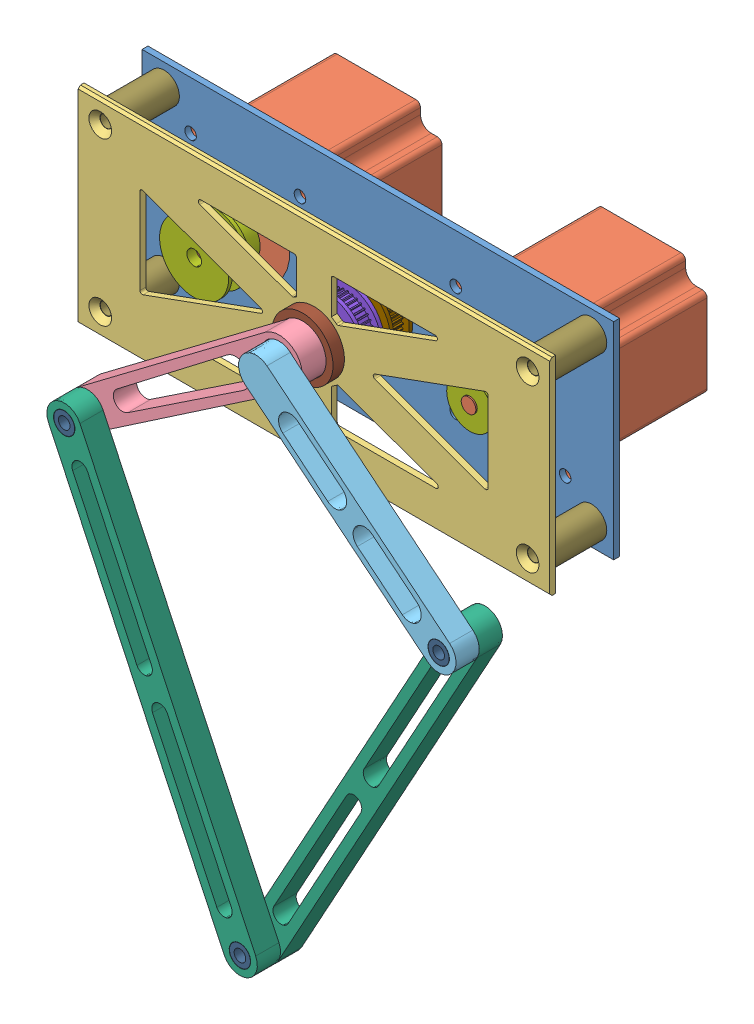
SolidWorks assembly Full Assem.SLDASM, configuration Default (file format 13000). Lengths in mm.
Overall size (203.2 274.68 109.08).
23 component instances, 12 part files, 50 mates.
Components (placement in the parent):
- Motor Plate-1: Motor Plate.SLDPRT [Default] at (75.9678 110.6506 152.779) size (203.2 88.9 2.54)
- NEMA23-1: NEMA23.SLDPRT [Varsayılan] at (18.8428 110.6506 151.509) x (0 1 0) z (0 0 1) size (56.4 56.4 74.6)
- NEMA23-2: NEMA23.SLDPRT [Varsayılan] at (133.0928 110.6506 151.509) size (56.4 56.4 74.6)
- Front Plate-1: Front Plate.SLDPRT [Default] at (75.9678 110.6506 180.319) size (203.2 88.9 2.54)
- Short Linkage Outer-1: Short Linkage Outer.SLDPRT [Default] at (75.9678 110.6506 196.589) x (-0.582335 0.812949 0) z (0 0 -1) size (20 119.1 32.94)
- Short Linkage Inner-1: Short Linkage Inner.SLDPRT [Default] at (115.3352 78.5437 206.589) x (-0.632024 -0.774949 0) z (0 0 -1) size (15 116.6 60.08)
- Long Linkage V1-1: Long Linkage V1.SLDPRT [Default] at (111.8924 -31.4765 186.589) x (0.876416 -0.481554 0) z (0 0 1) size (15 192.8 10)
- Long Linkage V1-2: Long Linkage V1.SLDPRT [Default] at (31.2272 -28.9523 196.589) x (0.90481 0.425816 0) z (0 0 1) size (15 192.8 10)
- motor pulleys-1: motor pulleys.SLDPRT [Default] at (123.9278 104.7502 157.939) x (0 0 1) z (0.541314 -0.84082 0) size (18.41 29.8 29.8)
- motor pulleys-2: motor pulleys.SLDPRT [Default] at (10.9792 118.1987 171.2421) x (0 0 -1) z (0.692492 0.721426 0) size (18.41 29.8 29.8)
- outer shaft pulley 20.25mm-1: outer shaft pulley 20.25mm.SLDPRT [Default] at (75.9678 110.6506 171.049) x (0.582335 -0.812949 0) z (0 0 1) size (30 30 9.6)
- inner shaft pulley v2-1: inner shaft pulley v2.SLDPRT [Default] at (75.9478 110.5272 158.849) x (0.774949 -0.632024 0) z (0 0 1) size (30 30 9.6)
- Brass Bushing-1: Brass Bushing.SLDPRT [Default] at (-6.6278 51.4853 201.589) x (0.4597 0.888074 0) z (-0.888074 0.4597 0) size (9 10 9)
- Brass Bushing-2: Brass Bushing.SLDPRT [Default] at (-6.6278 51.4853 191.589) x (0.864191 0.503164 0) z (-0.503164 0.864191 0) size (9 10 9)
- Brass Bushing-3: Brass Bushing.SLDPRT [Default] at (154.7026 46.4369 191.589) x (0.864191 0.503164 0) z (-0.503164 0.864191 0) size (9 10 9)
- Brass Bushing-4: Brass Bushing.SLDPRT [Default] at (154.7026 46.4369 201.589) x (0.938309 0.345799 0) z (-0.345799 0.938309 0) size (9 10 9)
- Brass Bushing-5: Brass Bushing.SLDPRT [Default] at (69.0822 -109.3899 191.589) x (0.864191 0.503164 0) z (-0.503164 0.864191 0) size (9 10 9)
- Brass Bushing-6: Brass Bushing.SLDPRT [Default] at (69.0822 -109.3899 201.589) x (-0.505691 0.862715 0) z (-0.862715 -0.505691 0) size (9 10 9)
- 5mm spacer-3: 5mm spacer.SLDPRT [Default] at (75.9678 110.6506 186.489) x (0.800581 -0.599225 0) z (0.599225 0.800581 0) size (26.26 4.9 26.26)
- Gear Box Spacer-5: Gear Box Spacer.SLDPRT [Default] at (168.0428 75.7256 166.549) x (0.994186 -0.107675 0) z (0 0 1) size (13.11 13.11 25)
- Gear Box Spacer-6: Gear Box Spacer.SLDPRT [Default] at (168.0428 145.5756 166.549) x (0.933353 -0.358959 0) z (0 0 1) size (13.11 13.11 25)
- Gear Box Spacer-7: Gear Box Spacer.SLDPRT [Default] at (-16.1072 75.7256 166.549) x (0.967065 -0.254529 0) z (0 0 1) size (13.11 13.11 25)
- Gear Box Spacer-8: Gear Box Spacer.SLDPRT [Default] at (-16.1072 145.5756 166.549) size (13.11 13.11 25)
Mates (geometry in assembly coordinates):
- Concentric3: concentric aligned: circle of Motor Plate-1; circle of NEMA23-1
- Coincident4: coincident anti-aligned: plane of Motor Plate-1 through (75.9678 110.6506 151.509) normal (0 0 -1); plane of NEMA23-1 through (-4.7272 134.2206 151.509) normal (0 0 1)
- Concentric4: concentric anti-aligned: cylinder of Motor Plate-1 through (-4.7272 134.2206 154.049) axis (0 0 -1) radius 2.5; cylinder of NEMA23-1 through (-4.7272 134.2206 146.509) axis (0 0 1) radius 2.5
- Coincident6: coincident anti-aligned: plane of Motor Plate-1 through (75.9678 110.6506 151.509) normal (0 0 -1); plane of NEMA23-2 through (156.6628 134.2206 151.509) normal (0 0 1)
- Concentric7: concentric anti-aligned: circle of Front Plate-1; circle of Short Linkage Outer-1
- Coincident17: coincident anti-aligned: plane of Short Linkage Outer-1 through (75.9678 110.6506 196.589) normal (0 0 1); plane of Short Linkage Inner-1 through (115.3352 78.5437 196.589) normal (0 0 -1)
- Coincident18: coincident anti-aligned: circle of Short Linkage Outer-1; circle of Long Linkage V1-2
- Coincident19: coincident anti-aligned: circle of Short Linkage Inner-1; circle of Long Linkage V1-1
- Coincident20: coincident aligned: circle of Long Linkage V1-1; circle of Long Linkage V1-2
- Concentric9: concentric aligned: circle of Short Linkage Outer-1; circle of Short Linkage Inner-1
- Coincident22: coincident aligned: circle of NEMA23-2; circle of motor pulleys-1
- Concentric10: concentric anti-aligned: circle of Short Linkage Outer-1; circle of outer shaft pulley v2-1
- Parallel2: parallel anti-aligned: plane of Short Linkage Outer-1 through (89.0051 107.6477 175.849) normal (0.812949 0.582335 0); plane of outer shaft pulley 20.25mm-1 through (82.9795 115.6732 166.249) normal (-0.812949 -0.582335 0)
- Coincident28: coincident anti-aligned: plane of Short Linkage Outer-1 through (75.9678 110.6506 175.849) normal (0 0 -1); plane of outer shaft pulley 20.25mm-1 through (75.9678 110.6506 175.849) normal (0 0 1)
- Coincident30: coincident anti-aligned: plane of Short Linkage Inner-1 through (70.1557 115.3907 146.509) normal (-0.355113 0.934823 0); plane of inner shaft pulley v2-1 through (77.1668 118.0541 154.049) normal (0.355113 -0.934823 0)
- Coincident31: coincident anti-aligned: plane of Short Linkage Inner-1 through (77.1668 118.0541 146.509) normal (0.632024 0.774949 0); plane of inner shaft pulley v2-1 through (83.0758 113.2349 154.049) normal (-0.632024 -0.774949 0)
- Coincident32: coincident anti-aligned: plane of Short Linkage Outer-1 through (75.9678 110.6506 163.649) normal (0 0 -1); plane of inner shaft pulley v2-1 through (75.9478 110.5272 163.649) normal (0 0 1)
- Concentric17: concentric anti-aligned: circle of Long Linkage V1-2; circle of Brass Bushing-1
- Coincident40: coincident aligned: circle of Long Linkage V1-2; plane of Brass Bushing-1 through (-6.6278 51.4853 206.589) normal (0 0 1)
- Concentric19: concentric anti-aligned: circle of Long Linkage V1-2; circle of Brass Bushing-2
- Coincident41: coincident aligned: circle of Short Linkage Outer-1; plane of Brass Bushing-2 through (-6.6278 51.4853 186.589) normal (0 0 -1)
- Concentric20: concentric aligned: cylinder of Short Linkage Inner-1 through (154.7026 46.4369 196.589) axis (0 0 1) radius 4.625; cylinder of Brass Bushing-4 through (154.7026 46.4369 196.589) axis (0 0 1) radius 4.5
- Coincident42: coincident anti-aligned: circle of Short Linkage Inner-1; plane of Brass Bushing-4 through (154.7026 46.4369 206.589) normal (0 0 1)
- Concentric22: concentric anti-aligned: cylinder of Long Linkage V1-1 through (154.7026 46.4369 196.589) axis (0 0 -1) radius 4.635; cylinder of Brass Bushing-3 through (154.7026 46.4369 186.589) axis (0 0 1) radius 4.5
- Coincident43: coincident anti-aligned: circle of Long Linkage V1-1; plane of Brass Bushing-3 through (154.7026 46.4369 186.589) normal (0 0 -1)
- Concentric23: concentric anti-aligned: cylinder of Long Linkage V1-2 through (69.0822 -109.3899 206.589) axis (0 0 -1) radius 4.635; cylinder of Brass Bushing-6 through (69.0822 -109.3899 196.589) axis (0 0 1) radius 4.5
- Coincident44: coincident aligned: circle of Long Linkage V1-2; plane of Brass Bushing-6 through (69.0822 -109.3899 206.589) normal (0 0 1)
- Concentric24: concentric anti-aligned: cylinder of Long Linkage V1-1 through (69.0822 -109.3899 196.589) axis (0 0 -1) radius 4.635; cylinder of Brass Bushing-5 through (69.0822 -109.3899 186.589) axis (0 0 1) radius 4.5
- Coincident46: coincident anti-aligned: circle of Long Linkage V1-1; plane of Brass Bushing-5 through (69.0822 -109.3899 186.589) normal (0 0 -1)
- Distance1: distance = 5 mm anti-aligned: plane of Front Plate-1 through (75.9678 110.6506 181.589) normal (0 0 1); plane of Short Linkage Outer-1 through (75.9678 110.6506 186.589) normal (0 0 -1)
- Concentric25: concentric aligned: cylinder of NEMA23-1 through (18.8428 110.6506 172.109) axis (0 0 -1) radius 3.175; cylinder of motor pulleys-2 through (18.8428 110.6506 176.0721) axis (0 0 -1) radius 3.175
- Concentric28: concentric aligned: circle of Brass Bushing-3; circle of Brass Bushing-4
- Coincident51: coincident aligned: circle of Motor Plate-1; circle of NEMA23-2
- Coincident52: coincident aligned: circle of Motor Plate-1; circle of NEMA23-2
- Concentric29: concentric anti-aligned: cylinder of Short Linkage Outer-1 through (75.9678 110.6506 163.649) axis (0 0 1) radius 10; circle of 5mm spacer-3
- Coincident53: coincident anti-aligned: plane of Front Plate-1 through (75.9678 110.6506 181.589) normal (0 0 1); circle of 5mm spacer-3
- Concentric30: concentric aligned: circle of Motor Plate-1; circle of Gear Box Spacer-8
- Coincident54: coincident anti-aligned: plane of Front Plate-1 through (75.9678 110.6506 179.049) normal (0 0 -1); circle of Gear Box Spacer-8
- Coincident56: coincident: plane of Gear Box Spacer-8 through (-16.1072 145.5756 154.049) normal (0 0 -1); line of Motor Plate-1 through (177.5678 155.1006 154.049) axis (-1 0 0)
- Coincident57: coincident anti-aligned: plane of Gear Box Spacer-8 through (-16.1072 145.5756 154.049) normal (0 0 -1); plane of Motor Plate-1 through (75.9678 110.6506 154.049) normal (0 0 1)
- Concentric31: concentric anti-aligned: circle of Front Plate-1; circle of Gear Box Spacer-6
- Coincident58: coincident anti-aligned: plane of Motor Plate-1 through (75.9678 110.6506 154.049) normal (0 0 1); plane of Gear Box Spacer-6 through (168.0428 145.5756 154.049) normal (0 0 -1)
- Concentric32: concentric anti-aligned: cone of Front Plate-1 through (-16.1072 145.5756 181.589) axis (0 0 -1); circle of Gear Box Spacer-8
- Concentric33: concentric aligned: circle of Motor Plate-1; circle of Gear Box Spacer-6
- Concentric34: concentric anti-aligned: circle of Front Plate-1; circle of Gear Box Spacer-7
- Concentric35: concentric aligned: circle of Motor Plate-1; circle of Gear Box Spacer-7
- Coincident60: coincident aligned: plane of Motor Plate-1 through (75.9678 110.6506 154.049) normal (0 0 1); circle of Gear Box Spacer-7
- Concentric36: concentric aligned: circle of Motor Plate-1; circle of Gear Box Spacer-5
- Concentric37: concentric anti-aligned: circle of Front Plate-1; circle of Gear Box Spacer-5
- Coincident61: coincident anti-aligned: plane of Front Plate-1 through (75.9678 110.6506 179.049) normal (0 0 -1); plane of Gear Box Spacer-5 through (168.0428 75.7256 179.049) normal (0 0 1)
